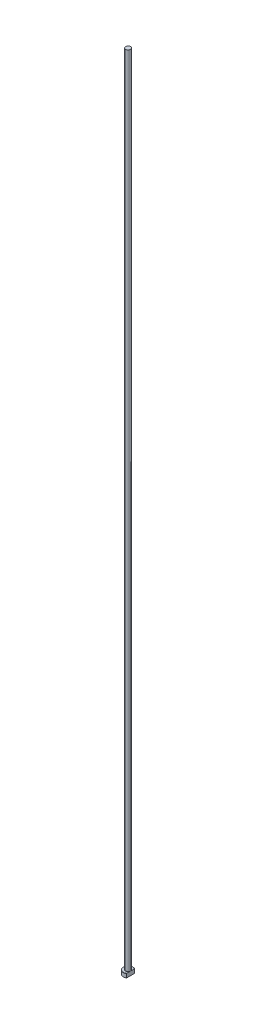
ISO-10303-21;
HEADER;
FILE_DESCRIPTION(('STEP AP214'),'2;1');
FILE_NAME('part.step','',(''),(''),'','','');
FILE_SCHEMA(('AUTOMOTIVE_DESIGN { 1 0 10303 214 1 1 1 1 }'));
ENDSEC;
DATA;
#1=APPLICATION_CONTEXT('core data for automotive mechanical design processes');
#2=APPLICATION_PROTOCOL_DEFINITION('international standard','automotive_design',2000,#1);
#3=PRODUCT_CONTEXT('',#1,'mechanical');
#4=PRODUCT('Part','Part','',(#3));
#5=PRODUCT_RELATED_PRODUCT_CATEGORY('part','',(#4));
#6=PRODUCT_DEFINITION_FORMATION('','',#4);
#7=PRODUCT_DEFINITION_CONTEXT('part definition',#1,'design');
#8=PRODUCT_DEFINITION('design','',#6,#7);
#9=PRODUCT_DEFINITION_SHAPE('','',#8);
#10=(LENGTH_UNIT() NAMED_UNIT(*) SI_UNIT(.MILLI.,.METRE.));
#11=(NAMED_UNIT(*) PLANE_ANGLE_UNIT() SI_UNIT($,.RADIAN.));
#12=(NAMED_UNIT(*) SI_UNIT($,.STERADIAN.) SOLID_ANGLE_UNIT());
#13=UNCERTAINTY_MEASURE_WITH_UNIT(LENGTH_MEASURE(1.E-05),#10,'distance_accuracy_value','');
#14=(GEOMETRIC_REPRESENTATION_CONTEXT(3) GLOBAL_UNCERTAINTY_ASSIGNED_CONTEXT((#13)) GLOBAL_UNIT_ASSIGNED_CONTEXT((#10,
#11,#12)) REPRESENTATION_CONTEXT('',''));
#15=CARTESIAN_POINT('',(0.,0.,0.));
#16=DIRECTION('',(0.,0.,1.));
#17=DIRECTION('',(1.,0.,0.));
#18=AXIS2_PLACEMENT_3D('',#15,#16,#17);
#19=CARTESIAN_POINT('',(0.,0.,0.));
#20=DIRECTION('',(0.,-1.,0.));
#21=DIRECTION('',(0.,0.,-1.));
#22=AXIS2_PLACEMENT_3D('',#19,#20,#21);
#23=PLANE('',#22);
#24=CARTESIAN_POINT('',(0.,0.,0.));
#25=DIRECTION('',(0.,-1.,0.));
#26=DIRECTION('',(0.,0.,-1.));
#27=AXIS2_PLACEMENT_3D('',#24,#25,#26);
#28=CIRCLE('',#27,5.79999999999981);
#29=CARTESIAN_POINT('',(2.99999999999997,0.,4.96386945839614));
#30=VERTEX_POINT('',#29);
#31=CARTESIAN_POINT('',(2.99999999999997,0.,-4.96386945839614));
#32=VERTEX_POINT('',#31);
#33=EDGE_CURVE('E98',#30,#32,#28,.T.);
#34=ORIENTED_EDGE('',*,*,#33,.T.);
#35=DIRECTION('',(0.,0.,1.));
#36=VECTOR('',#35,1.);
#37=CARTESIAN_POINT('',(2.99999999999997,0.,-5.19615242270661));
#38=LINE('',#37,#36);
#39=EDGE_CURVE('E83',#32,#30,#38,.T.);
#40=ORIENTED_EDGE('',*,*,#39,.T.);
#41=EDGE_LOOP('',(#34,#40));
#42=FACE_BOUND('',#41,.T.);
#43=ADVANCED_FACE('F32',(#42),#23,.T.);
#44=CARTESIAN_POINT('',(0.,259.958771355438,0.));
#45=DIRECTION('',(0.,1.,0.));
#46=DIRECTION('',(0.,0.,1.));
#47=AXIS2_PLACEMENT_3D('',#44,#45,#46);
#48=CYLINDRICAL_SURFACE('',#47,5.99999999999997);
#49=CARTESIAN_POINT('',(0.,4.80000000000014,0.));
#50=DIRECTION('',(0.,1.,0.));
#51=DIRECTION('',(0.,0.,1.));
#52=AXIS2_PLACEMENT_3D('',#49,#50,#51);
#53=CIRCLE('',#52,5.99999999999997);
#54=CARTESIAN_POINT('',(2.99999999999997,4.80000000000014,5.19615242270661));
#55=VERTEX_POINT('',#54);
#56=CARTESIAN_POINT('',(2.99999999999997,4.80000000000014,-5.19615242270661));
#57=VERTEX_POINT('',#56);
#58=EDGE_CURVE('E104',#55,#57,#53,.F.);
#59=ORIENTED_EDGE('',*,*,#58,.T.);
#60=DIRECTION('',(0.,-1.,0.));
#61=VECTOR('',#60,1.);
#62=CARTESIAN_POINT('',(2.99999999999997,1000.,-5.19615242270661));
#63=LINE('',#62,#61);
#64=CARTESIAN_POINT('',(2.99999999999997,0.200000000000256,-5.19615242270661));
#65=VERTEX_POINT('',#64);
#66=EDGE_CURVE('E183',#57,#65,#63,.T.);
#67=ORIENTED_EDGE('',*,*,#66,.T.);
#68=CARTESIAN_POINT('',(0.,0.200000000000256,0.));
#69=DIRECTION('',(0.,-1.,0.));
#70=DIRECTION('',(0.,0.,-1.));
#71=AXIS2_PLACEMENT_3D('',#68,#69,#70);
#72=CIRCLE('',#71,5.99999999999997);
#73=CARTESIAN_POINT('',(2.99999999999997,0.200000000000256,5.19615242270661));
#74=VERTEX_POINT('',#73);
#75=EDGE_CURVE('E100',#65,#74,#72,.F.);
#76=ORIENTED_EDGE('',*,*,#75,.T.);
#77=DIRECTION('',(0.,-1.,0.));
#78=VECTOR('',#77,1.);
#79=CARTESIAN_POINT('',(2.99999999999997,1000.,5.19615242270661));
#80=LINE('',#79,#78);
#81=EDGE_CURVE('E93',#55,#74,#80,.T.);
#82=ORIENTED_EDGE('',*,*,#81,.F.);
#83=EDGE_LOOP('',(#59,#67,#76,#82));
#84=FACE_BOUND('',#83,.T.);
#85=ADVANCED_FACE('F158',(#84),#48,.T.);
#86=CARTESIAN_POINT('',(-5.99999999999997,5.,0.));
#87=DIRECTION('',(0.,1.,0.));
#88=DIRECTION('',(0.,0.,1.));
#89=AXIS2_PLACEMENT_3D('',#86,#87,#88);
#90=PLANE('',#89);
#91=CARTESIAN_POINT('',(0.,5.,0.));
#92=DIRECTION('',(0.,1.,0.));
#93=DIRECTION('',(0.,0.,1.));
#94=AXIS2_PLACEMENT_3D('',#91,#92,#93);
#95=CIRCLE('',#94,5.80000000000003);
#96=CARTESIAN_POINT('',(2.99999999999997,5.,-4.9638694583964));
#97=VERTEX_POINT('',#96);
#98=CARTESIAN_POINT('',(2.99999999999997,5.,4.9638694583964));
#99=VERTEX_POINT('',#98);
#100=EDGE_CURVE('E178',#97,#99,#95,.T.);
#101=ORIENTED_EDGE('',*,*,#100,.T.);
#102=DIRECTION('',(0.,0.,-1.));
#103=VECTOR('',#102,1.);
#104=CARTESIAN_POINT('',(2.99999999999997,5.,0.));
#105=LINE('',#104,#103);
#106=CARTESIAN_POINT('',(2.99999999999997,4.99999999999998,1.11355287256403));
#107=VERTEX_POINT('',#106);
#108=EDGE_CURVE('E57',#99,#107,#105,.T.);
#109=ORIENTED_EDGE('',*,*,#108,.T.);
#110=CARTESIAN_POINT('',(0.,5.,0.));
#111=DIRECTION('',(0.,1.,0.));
#112=DIRECTION('',(0.,0.,1.));
#113=AXIS2_PLACEMENT_3D('',#110,#111,#112);
#114=CIRCLE('',#113,3.19999999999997);
#115=CARTESIAN_POINT('',(2.99999999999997,4.99999999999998,-1.113552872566));
#116=VERTEX_POINT('',#115);
#117=EDGE_CURVE('E107',#107,#116,#114,.F.);
#118=ORIENTED_EDGE('',*,*,#117,.T.);
#119=EDGE_CURVE('E136',#116,#97,#105,.T.);
#120=ORIENTED_EDGE('',*,*,#119,.T.);
#121=EDGE_LOOP('',(#101,#109,#118,#120));
#122=FACE_BOUND('',#121,.T.);
#123=ADVANCED_FACE('F147',(#122),#90,.T.);
#124=CARTESIAN_POINT('',(0.,5.,0.));
#125=DIRECTION('',(0.,-1.,0.));
#126=DIRECTION('',(0.,0.,-1.));
#127=AXIS2_PLACEMENT_3D('',#124,#125,#126);
#128=CONICAL_SURFACE('',#127,5.80000000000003,0.785398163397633);
#129=ORIENTED_EDGE('',*,*,#58,.F.);
#130=CARTESIAN_POINT('',(2.99999999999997,-1.01993959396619,11.432889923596));
#131=CARTESIAN_POINT('',(2.99999999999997,-0.769424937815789,11.1738796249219));
#132=CARTESIAN_POINT('',(2.99999999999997,-0.519179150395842,10.91460841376));
#133=CARTESIAN_POINT('',(2.99999999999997,-0.0193842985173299,10.3953890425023));
#134=CARTESIAN_POINT('',(2.99999999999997,0.230164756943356,10.135440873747));
#135=CARTESIAN_POINT('',(2.99999999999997,0.72852805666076,9.61458602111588));
#136=CARTESIAN_POINT('',(2.99999999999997,0.977341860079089,9.35367891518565));
#137=CARTESIAN_POINT('',(2.99999999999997,1.47386965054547,8.83082274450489));
#138=CARTESIAN_POINT('',(2.99999999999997,1.72158364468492,8.56887368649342));
#139=CARTESIAN_POINT('',(2.99999999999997,2.21069282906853,8.04884148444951));
#140=CARTESIAN_POINT('',(2.99999999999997,2.45211594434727,7.79078462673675));
#141=CARTESIAN_POINT('',(2.99999999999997,2.93315589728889,7.2729934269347));
#142=CARTESIAN_POINT('',(2.99999999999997,3.172772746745,7.01325909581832));
#143=CARTESIAN_POINT('',(2.99999999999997,3.64950020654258,6.49159990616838));
#144=CARTESIAN_POINT('',(2.99999999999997,3.8866113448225,6.22967553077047));
#145=CARTESIAN_POINT('',(2.99999999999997,4.35738571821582,5.70275148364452));
#146=CARTESIAN_POINT('',(2.99999999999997,4.59104909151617,5.43775193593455));
#147=CARTESIAN_POINT('',(2.99999999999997,4.96416348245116,5.00636825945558));
#148=CARTESIAN_POINT('',(2.99999999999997,5.10520133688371,4.8413584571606));
#149=CARTESIAN_POINT('',(2.99999999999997,5.38476673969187,4.50919282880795));
#150=CARTESIAN_POINT('',(2.99999999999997,5.52329404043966,4.34203679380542));
#151=CARTESIAN_POINT('',(2.99999999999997,5.79842961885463,4.00319933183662));
#152=CARTESIAN_POINT('',(2.99999999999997,5.93500216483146,3.83148875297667));
#153=CARTESIAN_POINT('',(2.99999999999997,6.20336281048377,3.48442112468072));
#154=CARTESIAN_POINT('',(2.99999999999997,6.33515205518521,3.30906496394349));
#155=CARTESIAN_POINT('',(2.99999999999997,6.59393382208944,2.95070802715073));
#156=CARTESIAN_POINT('',(2.99999999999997,6.72082315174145,2.76763161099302));
#157=CARTESIAN_POINT('',(2.99999999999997,6.90336321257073,2.48771743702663));
#158=CARTESIAN_POINT('',(2.99999999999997,6.96295431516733,2.39345390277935));
#159=CARTESIAN_POINT('',(2.99999999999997,7.07882720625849,2.2029214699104));
#160=CARTESIAN_POINT('',(2.99999999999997,7.13510937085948,2.10665280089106));
#161=CARTESIAN_POINT('',(2.99999999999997,7.24288059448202,1.91297779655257));
#162=CARTESIAN_POINT('',(2.99999999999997,7.29441986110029,1.81559978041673));
#163=CARTESIAN_POINT('',(2.99999999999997,7.3924123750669,1.61833215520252));
#164=CARTESIAN_POINT('',(2.99999999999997,7.4388646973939,1.51844209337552));
#165=CARTESIAN_POINT('',(2.99999999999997,7.56840030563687,1.2151194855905));
#166=CARTESIAN_POINT('',(2.99999999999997,7.642090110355,1.00730397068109));
#167=CARTESIAN_POINT('',(2.99999999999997,7.72186700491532,0.695731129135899));
#168=CARTESIAN_POINT('',(2.99999999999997,7.74302901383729,0.595791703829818));
#169=CARTESIAN_POINT('',(2.99999999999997,7.77582528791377,0.394325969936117));
#170=CARTESIAN_POINT('',(2.99999999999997,7.78746040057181,0.292799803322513));
#171=CARTESIAN_POINT('',(2.99999999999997,7.80037895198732,0.0893987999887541));
#172=CARTESIAN_POINT('',(2.99999999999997,7.80169449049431,-0.0124739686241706));
#173=CARTESIAN_POINT('',(2.99999999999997,7.79396363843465,-0.215826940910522));
#174=CARTESIAN_POINT('',(2.99999999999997,7.78491639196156,-0.317307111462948));
#175=CARTESIAN_POINT('',(2.99999999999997,7.75721241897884,-0.518039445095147));
#176=CARTESIAN_POINT('',(2.99999999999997,7.73863812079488,-0.617303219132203));
#177=CARTESIAN_POINT('',(2.99999999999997,7.69303955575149,-0.813850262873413));
#178=CARTESIAN_POINT('',(2.99999999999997,7.66601427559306,-0.911133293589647));
#179=CARTESIAN_POINT('',(2.99999999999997,7.60464499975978,-1.1039484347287));
#180=CARTESIAN_POINT('',(2.99999999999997,7.57025976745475,-1.19946724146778));
#181=CARTESIAN_POINT('',(2.99999999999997,7.49555762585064,-1.38810736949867));
#182=CARTESIAN_POINT('',(2.99999999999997,7.45524192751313,-1.48122917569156));
#183=CARTESIAN_POINT('',(2.99999999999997,7.36961028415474,-1.66561491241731));
#184=CARTESIAN_POINT('',(2.99999999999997,7.32427350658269,-1.75686908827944));
#185=CARTESIAN_POINT('',(2.99999999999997,7.22966073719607,-1.93732130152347));
#186=CARTESIAN_POINT('',(2.99999999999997,7.18038388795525,-2.02651888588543));
#187=CARTESIAN_POINT('',(2.99999999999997,7.02771106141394,-2.29153460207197));
#188=CARTESIAN_POINT('',(2.99999999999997,6.91955486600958,-2.46460625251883));
#189=CARTESIAN_POINT('',(2.99999999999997,6.69440299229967,-2.80577028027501));
#190=CARTESIAN_POINT('',(2.99999999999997,6.57737415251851,-2.97384034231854));
#191=CARTESIAN_POINT('',(2.99999999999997,6.33748949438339,-3.30561771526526));
#192=CARTESIAN_POINT('',(2.99999999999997,6.21463662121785,-3.46932716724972));
#193=CARTESIAN_POINT('',(2.99999999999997,5.9630808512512,-3.79561670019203));
#194=CARTESIAN_POINT('',(2.99999999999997,5.83432224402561,-3.95815356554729));
#195=CARTESIAN_POINT('',(2.99999999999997,5.57361365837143,-4.28066737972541));
#196=CARTESIAN_POINT('',(2.99999999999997,5.44166333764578,-4.44064405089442));
#197=CARTESIAN_POINT('',(2.99999999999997,5.17568445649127,-4.75819552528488));
#198=CARTESIAN_POINT('',(2.99999999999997,5.0416617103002,-4.91577521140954));
#199=CARTESIAN_POINT('',(2.99999999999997,4.7717623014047,-5.22934053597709));
#200=CARTESIAN_POINT('',(2.99999999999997,4.63588560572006,-5.38532614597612));
#201=CARTESIAN_POINT('',(2.99999999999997,4.27256222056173,-5.79849838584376));
#202=CARTESIAN_POINT('',(2.99999999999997,4.04384014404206,-6.05456265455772));
#203=CARTESIAN_POINT('',(2.99999999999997,3.58360020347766,-6.56417037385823));
#204=CARTESIAN_POINT('',(2.99999999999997,3.35208226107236,-6.81771375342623));
#205=CARTESIAN_POINT('',(2.99999999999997,2.88678846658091,-7.32315936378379));
#206=CARTESIAN_POINT('',(2.99999999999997,2.65301069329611,-7.5750598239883));
#207=CARTESIAN_POINT('',(2.99999999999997,2.18392232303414,-8.07742926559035));
#208=CARTESIAN_POINT('',(2.99999999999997,1.94861172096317,-8.32789824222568));
#209=CARTESIAN_POINT('',(2.99999999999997,1.48651581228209,-8.81743943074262));
#210=CARTESIAN_POINT('',(2.99999999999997,1.25977806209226,-9.05655656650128));
#211=CARTESIAN_POINT('',(2.99999999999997,0.805439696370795,-9.53397105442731));
#212=CARTESIAN_POINT('',(2.99999999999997,0.577839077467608,-9.77226840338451));
#213=CARTESIAN_POINT('',(2.99999999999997,0.122198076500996,-10.24793256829));
#214=CARTESIAN_POINT('',(2.99999999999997,-0.105841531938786,-10.4853001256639));
#215=CARTESIAN_POINT('',(2.99999999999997,-0.562491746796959,-10.9594816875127));
#216=CARTESIAN_POINT('',(2.99999999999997,-0.791102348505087,-11.196295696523));
#217=CARTESIAN_POINT('',(2.99999999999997,-1.01993959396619,-11.432889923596));
#218=B_SPLINE_CURVE_WITH_KNOTS('',3,(#130,#131,#132,#133,#134,#135,#136,#137,#138,#139,#140,
#141,#142,#143,#144,#145,#146,#147,#148,#149,#150,#151,#152,#153,#154,#155,#156,#157,#158,#159,
#160,#161,#162,#163,#164,#165,#166,#167,#168,#169,#170,#171,#172,#173,#174,#175,#176,#177,#178,
#179,#180,#181,#182,#183,#184,#185,#186,#187,#188,#189,#190,#191,#192,#193,#194,#195,#196,#197,
#198,#199,#200,#201,#202,#203,#204,#205,#206,#207,#208,#209,#210,#211,#212,#213,#214,#215,#216,
#217),.UNSPECIFIED.,.F.,.F.,(4,2,2,2,2,2,2,2,2,2,2,2,2,2,2,2,2,2,2,2,2,2,2,2,2,2,2,2,2,2,2,2,2,
2,2,2,2,2,2,2,2,2,2,4),(0.,1.08101662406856,2.16204714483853,3.24363027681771,4.32520642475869,
5.3853446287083,6.44547590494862,7.50537917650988,8.56523985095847,9.21643479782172,
9.86769362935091,10.5258323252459,11.183812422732,11.8517813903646,12.1862877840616,
12.5207560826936,12.8511332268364,13.1815703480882,13.8399161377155,14.1460077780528,
14.4520721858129,14.7571841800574,15.0623213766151,15.3648619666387,15.6674388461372,
15.9717575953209,16.2760142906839,16.5815843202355,16.8872210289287,17.4990577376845,
18.1133060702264,18.7272470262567,19.3492675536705,19.9713550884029,20.5919343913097,
21.2125247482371,22.2425132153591,23.272530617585,24.3035181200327,25.3345090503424,
26.3230827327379,27.3116602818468,28.2991352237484,29.2866020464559),.UNSPECIFIED.);
#219=EDGE_CURVE('E135',#55,#99,#218,.T.);
#220=ORIENTED_EDGE('',*,*,#219,.T.);
#221=ORIENTED_EDGE('',*,*,#100,.F.);
#222=EDGE_CURVE('E127',#97,#57,#218,.T.);
#223=ORIENTED_EDGE('',*,*,#222,.T.);
#224=EDGE_LOOP('',(#129,#220,#221,#223));
#225=FACE_BOUND('',#224,.T.);
#226=ADVANCED_FACE('F143',(#225),#128,.T.);
#227=CARTESIAN_POINT('',(0.,0.200000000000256,0.));
#228=DIRECTION('',(0.,1.,0.));
#229=DIRECTION('',(0.,0.,1.));
#230=AXIS2_PLACEMENT_3D('',#227,#228,#229);
#231=CONICAL_SURFACE('',#230,5.99999999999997,0.785398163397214);
#232=ORIENTED_EDGE('',*,*,#75,.F.);
#233=CARTESIAN_POINT('',(2.99999999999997,6.01993959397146,-11.432889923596));
#234=CARTESIAN_POINT('',(2.99999999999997,5.7694249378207,-11.1738796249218));
#235=CARTESIAN_POINT('',(2.99999999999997,5.51917915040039,-10.9146084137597));
#236=CARTESIAN_POINT('',(2.99999999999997,5.01938429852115,-10.3953890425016));
#237=CARTESIAN_POINT('',(2.99999999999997,4.76983524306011,-10.1354408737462));
#238=CARTESIAN_POINT('',(2.99999999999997,4.27147194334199,-9.61458602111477));
#239=CARTESIAN_POINT('',(2.99999999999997,4.0226581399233,-9.35367891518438));
#240=CARTESIAN_POINT('',(2.99999999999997,3.5261303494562,-8.8308227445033));
#241=CARTESIAN_POINT('',(2.99999999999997,3.2784163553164,-8.56887368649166));
#242=CARTESIAN_POINT('',(2.99999999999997,2.78930717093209,-8.04884148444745));
#243=CARTESIAN_POINT('',(2.99999999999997,2.54788405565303,-7.79078462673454));
#244=CARTESIAN_POINT('',(2.99999999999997,2.06684410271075,-7.27299342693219));
#245=CARTESIAN_POINT('',(2.99999999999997,1.82722725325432,-7.01325909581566));
#246=CARTESIAN_POINT('',(2.99999999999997,1.35049979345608,-6.49159990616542));
#247=CARTESIAN_POINT('',(2.99999999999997,1.11338865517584,-6.22967553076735));
#248=CARTESIAN_POINT('',(2.99999999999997,0.64261428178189,-5.70275148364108));
#249=CARTESIAN_POINT('',(2.99999999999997,0.408950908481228,-5.43775193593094));
#250=CARTESIAN_POINT('',(2.99999999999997,0.0358365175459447,-5.00636825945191));
#251=CARTESIAN_POINT('',(2.99999999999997,-0.1052013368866,-4.84135845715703));
#252=CARTESIAN_POINT('',(2.99999999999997,-0.384766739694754,-4.5091928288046));
#253=CARTESIAN_POINT('',(2.99999999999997,-0.523294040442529,-4.34203679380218));
#254=CARTESIAN_POINT('',(2.99999999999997,-0.798429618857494,-4.00319933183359));
#255=CARTESIAN_POINT('',(2.99999999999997,-0.935002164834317,-3.83148875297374));
#256=CARTESIAN_POINT('',(2.99999999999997,-1.20336281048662,-3.48442112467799));
#257=CARTESIAN_POINT('',(2.99999999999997,-1.33515205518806,-3.30906496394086));
#258=CARTESIAN_POINT('',(2.99999999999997,-1.59393382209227,-2.95070802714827));
#259=CARTESIAN_POINT('',(2.99999999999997,-1.72082315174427,-2.76763161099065));
#260=CARTESIAN_POINT('',(2.99999999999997,-1.90336321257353,-2.48771743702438));
#261=CARTESIAN_POINT('',(2.99999999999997,-1.96295431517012,-2.39345390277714));
#262=CARTESIAN_POINT('',(2.99999999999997,-2.07882720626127,-2.20292146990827));
#263=CARTESIAN_POINT('',(2.99999999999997,-2.13510937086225,-2.10665280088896));
#264=CARTESIAN_POINT('',(2.99999999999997,-2.24288059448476,-1.91297779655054));
#265=CARTESIAN_POINT('',(2.99999999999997,-2.29441986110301,-1.81559978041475));
#266=CARTESIAN_POINT('',(2.99999999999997,-2.39241237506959,-1.61833215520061));
#267=CARTESIAN_POINT('',(2.99999999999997,-2.43886469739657,-1.51844209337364));
#268=CARTESIAN_POINT('',(2.99999999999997,-2.56840030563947,-1.21511948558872));
#269=CARTESIAN_POINT('',(2.99999999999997,-2.64209011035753,-1.00730397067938));
#270=CARTESIAN_POINT('',(2.99999999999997,-2.72186700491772,-0.695731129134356));
#271=CARTESIAN_POINT('',(2.99999999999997,-2.74302901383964,-0.595791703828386));
#272=CARTESIAN_POINT('',(2.99999999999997,-2.77582528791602,-0.394325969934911));
#273=CARTESIAN_POINT('',(2.99999999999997,-2.78746040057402,-0.292799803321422));
#274=CARTESIAN_POINT('',(2.99999999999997,-2.80037895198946,-0.0893987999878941));
#275=CARTESIAN_POINT('',(2.99999999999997,-2.80169449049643,0.0124739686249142));
#276=CARTESIAN_POINT('',(2.99999999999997,-2.79396363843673,0.215826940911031));
#277=CARTESIAN_POINT('',(2.99999999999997,-2.78491639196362,0.317307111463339));
#278=CARTESIAN_POINT('',(2.99999999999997,-2.7572124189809,0.518039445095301));
#279=CARTESIAN_POINT('',(2.99999999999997,-2.73863812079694,0.617303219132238));
#280=CARTESIAN_POINT('',(2.99999999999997,-2.69303955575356,0.813850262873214));
#281=CARTESIAN_POINT('',(2.99999999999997,-2.66601427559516,0.911133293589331));
#282=CARTESIAN_POINT('',(2.99999999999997,-2.60464499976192,1.10394843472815));
#283=CARTESIAN_POINT('',(2.99999999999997,-2.57025976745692,1.19946724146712));
#284=CARTESIAN_POINT('',(2.99999999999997,-2.49555762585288,1.38810736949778));
#285=CARTESIAN_POINT('',(2.99999999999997,-2.45524192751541,1.48122917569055));
#286=CARTESIAN_POINT('',(2.99999999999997,-2.36961028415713,1.66561491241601));
#287=CARTESIAN_POINT('',(2.99999999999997,-2.32427350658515,1.75686908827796));
#288=CARTESIAN_POINT('',(2.99999999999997,-2.2296607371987,1.93732130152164));
#289=CARTESIAN_POINT('',(2.99999999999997,-2.18038388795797,2.02651888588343));
#290=CARTESIAN_POINT('',(2.99999999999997,-2.02771106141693,2.29153460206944));
#291=CARTESIAN_POINT('',(2.99999999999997,-1.91955486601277,2.46460625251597));
#292=CARTESIAN_POINT('',(2.99999999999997,-1.69440299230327,2.80577028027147));
#293=CARTESIAN_POINT('',(2.99999999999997,-1.57737415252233,2.97384034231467));
#294=CARTESIAN_POINT('',(2.99999999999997,-1.33748949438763,3.30561771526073));
#295=CARTESIAN_POINT('',(2.99999999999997,-1.21463662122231,3.46932716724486));
#296=CARTESIAN_POINT('',(2.99999999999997,-0.963080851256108,3.79561670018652));
#297=CARTESIAN_POINT('',(2.99999999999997,-0.834322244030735,3.95815356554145));
#298=CARTESIAN_POINT('',(2.99999999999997,-0.573613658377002,4.28066737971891));
#299=CARTESIAN_POINT('',(2.99999999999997,-0.441663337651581,4.4406440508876));
#300=CARTESIAN_POINT('',(2.99999999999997,-0.175684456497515,4.75819552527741));
#301=CARTESIAN_POINT('',(2.99999999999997,-0.0416617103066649,4.91577521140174));
#302=CARTESIAN_POINT('',(2.99999999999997,0.228237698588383,5.22934053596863));
#303=CARTESIAN_POINT('',(2.99999999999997,0.364114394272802,5.38532614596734));
#304=CARTESIAN_POINT('',(2.99999999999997,0.727437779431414,5.79849838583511));
#305=CARTESIAN_POINT('',(2.99999999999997,0.956159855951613,6.05456265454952));
#306=CARTESIAN_POINT('',(2.99999999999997,1.41639979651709,6.5641703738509));
#307=CARTESIAN_POINT('',(2.99999999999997,1.64791773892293,6.81771375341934));
#308=CARTESIAN_POINT('',(2.99999999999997,2.11321153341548,7.32315936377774));
#309=CARTESIAN_POINT('',(2.99999999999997,2.34698930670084,7.57505982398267));
#310=CARTESIAN_POINT('',(2.99999999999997,2.81607767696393,8.07742926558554));
#311=CARTESIAN_POINT('',(2.99999999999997,3.05138827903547,8.32789824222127));
#312=CARTESIAN_POINT('',(2.99999999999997,3.51348418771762,8.81743943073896));
#313=CARTESIAN_POINT('',(2.99999999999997,3.74022193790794,9.05655656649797));
#314=CARTESIAN_POINT('',(2.99999999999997,4.19456030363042,9.53397105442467));
#315=CARTESIAN_POINT('',(2.99999999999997,4.42216092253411,9.7722684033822));
#316=CARTESIAN_POINT('',(2.99999999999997,4.87780192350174,10.2479325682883));
#317=CARTESIAN_POINT('',(2.99999999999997,5.10584153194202,10.4853001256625));
#318=CARTESIAN_POINT('',(2.99999999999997,5.56249174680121,10.959481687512));
#319=CARTESIAN_POINT('',(2.99999999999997,5.79110234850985,11.1962956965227));
#320=CARTESIAN_POINT('',(2.99999999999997,6.01993959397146,11.432889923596));
#321=B_SPLINE_CURVE_WITH_KNOTS('',3,(#233,#234,#235,#236,#237,#238,#239,#240,#241,#242,#243,
#244,#245,#246,#247,#248,#249,#250,#251,#252,#253,#254,#255,#256,#257,#258,#259,#260,#261,#262,
#263,#264,#265,#266,#267,#268,#269,#270,#271,#272,#273,#274,#275,#276,#277,#278,#279,#280,#281,
#282,#283,#284,#285,#286,#287,#288,#289,#290,#291,#292,#293,#294,#295,#296,#297,#298,#299,#300,
#301,#302,#303,#304,#305,#306,#307,#308,#309,#310,#311,#312,#313,#314,#315,#316,#317,#318,#319,
#320),.UNSPECIFIED.,.F.,.F.,(4,2,2,2,2,2,2,2,2,2,2,2,2,2,2,2,2,2,2,2,2,2,2,2,2,2,2,2,2,2,2,2,2,
2,2,2,2,2,2,2,2,2,2,4),(0.,1.08101662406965,2.16204714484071,3.24363027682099,4.32520642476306,
5.38534462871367,6.44547590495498,7.50537917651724,8.56523985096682,9.2164347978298,
9.86769362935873,10.5258323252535,11.1838124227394,11.8517813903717,12.1862877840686,
12.5207560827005,12.8511332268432,13.1815703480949,13.8399161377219,14.1460077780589,
14.4520721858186,14.7571841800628,15.0623213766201,15.3648619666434,15.6674388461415,
15.9717575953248,16.2760142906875,16.5815843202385,16.8872210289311,17.4990577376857,
18.1133060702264,18.7272470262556,19.3492675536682,19.9713550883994,20.591934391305,
21.2125247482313,22.2425132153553,23.2725306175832,24.303518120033,25.3345090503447,
26.3230827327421,27.3116602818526,28.2991352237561,29.2866020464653),.UNSPECIFIED.);
#322=EDGE_CURVE('E86',#65,#32,#321,.T.);
#323=ORIENTED_EDGE('',*,*,#322,.T.);
#324=ORIENTED_EDGE('',*,*,#33,.F.);
#325=EDGE_CURVE('E89',#30,#74,#321,.T.);
#326=ORIENTED_EDGE('',*,*,#325,.T.);
#327=EDGE_LOOP('',(#232,#323,#324,#326));
#328=FACE_BOUND('',#327,.T.);
#329=ADVANCED_FACE('F97',(#328),#231,.T.);
#330=CARTESIAN_POINT('',(0.,5.19999999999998,0.));
#331=DIRECTION('',(0.,1.,0.));
#332=DIRECTION('',(0.,0.,1.));
#333=AXIS2_PLACEMENT_3D('',#330,#331,#332);
#334=TOROIDAL_SURFACE('',#333,3.19999999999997,0.2);
#335=CARTESIAN_POINT('',(2.99999999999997,5.19999999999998,0.));
#336=CARTESIAN_POINT('',(2.99999999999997,5.20000054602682,-8.25589702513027E-09));
#337=CARTESIAN_POINT('',(2.99999999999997,5.20000108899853,-2.22623702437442E-07));
#338=CARTESIAN_POINT('',(2.99999999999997,5.20000210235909,-8.13181300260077E-07));
#339=CARTESIAN_POINT('',(2.99999999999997,5.20000256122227,-1.20262206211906E-06));
#340=CARTESIAN_POINT('',(2.99999999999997,5.20000351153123,-2.13233189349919E-06));
#341=CARTESIAN_POINT('',(2.99999999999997,5.2000039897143,-2.68711073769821E-06));
#342=CARTESIAN_POINT('',(2.99999999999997,5.20000484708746,-3.83722986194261E-06));
#343=CARTESIAN_POINT('',(2.99999999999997,5.20000522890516,-4.43075968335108E-06));
#344=CARTESIAN_POINT('',(2.99999999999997,5.20000663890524,-6.71805399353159E-06));
#345=CARTESIAN_POINT('',(2.99999999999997,5.20000758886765,-8.46267320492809E-06));
#346=CARTESIAN_POINT('',(2.99999999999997,5.20000915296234,-1.19195937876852E-05));
#347=CARTESIAN_POINT('',(2.99999999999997,5.20000978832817,-1.36226966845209E-05));
#348=CARTESIAN_POINT('',(2.99999999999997,5.20001243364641,-2.07785327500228E-05));
#349=CARTESIAN_POINT('',(2.99999999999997,5.20001439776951,-2.62512686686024E-05));
#350=CARTESIAN_POINT('',(2.99999999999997,5.20001730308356,-3.65971251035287E-05));
#351=CARTESIAN_POINT('',(2.99999999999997,5.20001835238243,-4.14397201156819E-05));
#352=CARTESIAN_POINT('',(2.99999999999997,5.20002589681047,-7.68826107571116E-05));
#353=CARTESIAN_POINT('',(2.99999999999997,5.20003169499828,-0.000107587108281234));
#354=CARTESIAN_POINT('',(2.99999999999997,5.20005649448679,-0.000225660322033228));
#355=CARTESIAN_POINT('',(2.99999999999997,5.2000799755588,-0.000312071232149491));
#356=CARTESIAN_POINT('',(2.99999999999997,5.2001671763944,-0.000638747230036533));
#357=CARTESIAN_POINT('',(2.99999999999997,5.20022823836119,-0.000879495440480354));
#358=CARTESIAN_POINT('',(2.99999999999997,5.20046253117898,-0.00179757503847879));
#359=CARTESIAN_POINT('',(2.99999999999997,5.20063826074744,-0.00247448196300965));
#360=CARTESIAN_POINT('',(2.99999999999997,5.20145771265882,-0.00563611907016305));
#361=CARTESIAN_POINT('',(2.99999999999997,5.20209802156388,-0.00812138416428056));
#362=CARTESIAN_POINT('',(2.99999999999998,5.207470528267,-0.0289666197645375));
#363=CARTESIAN_POINT('',(2.99999999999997,5.2122144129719,-0.0473249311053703));
#364=CARTESIAN_POINT('',(2.99999999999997,5.2215041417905,-0.0833908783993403));
#365=CARTESIAN_POINT('',(2.99999999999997,5.22605099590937,-0.101098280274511));
#366=CARTESIAN_POINT('',(2.99999999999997,5.24071513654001,-0.158441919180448));
#367=CARTESIAN_POINT('',(2.99999999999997,5.25076238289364,-0.198096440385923));
#368=CARTESIAN_POINT('',(2.99999999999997,5.26735876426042,-0.264903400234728));
#369=CARTESIAN_POINT('',(2.99999999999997,5.27400650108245,-0.292031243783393));
#370=CARTESIAN_POINT('',(2.99999999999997,5.28691139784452,-0.345693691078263));
#371=CARTESIAN_POINT('',(2.99999999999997,5.29317409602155,-0.372226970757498));
#372=CARTESIAN_POINT('',(2.99999999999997,5.31359314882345,-0.460847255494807));
#373=CARTESIAN_POINT('',(2.99999999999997,5.3271194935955,-0.52308420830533));
#374=CARTESIAN_POINT('',(2.99999999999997,5.35185224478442,-0.648627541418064));
#375=CARTESIAN_POINT('',(2.99999999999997,5.36303576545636,-0.711938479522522));
#376=CARTESIAN_POINT('',(2.99999999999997,5.382697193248,-0.845442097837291));
#377=CARTESIAN_POINT('',(2.99999999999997,5.39079783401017,-0.915695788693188));
#378=CARTESIAN_POINT('',(2.99999999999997,5.39788104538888,-1.02128246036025));
#379=CARTESIAN_POINT('',(2.99999999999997,5.399399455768,-1.05644278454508));
#380=CARTESIAN_POINT('',(2.99999999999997,5.40031405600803,-1.12678521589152));
#381=CARTESIAN_POINT('',(2.99999999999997,5.39971158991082,-1.16196729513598));
#382=CARTESIAN_POINT('',(2.99999999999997,5.39660553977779,-1.21713951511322));
#383=CARTESIAN_POINT('',(2.99999999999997,5.39502683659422,-1.23718181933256));
#384=CARTESIAN_POINT('',(2.99999999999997,5.39080008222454,-1.27717351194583));
#385=CARTESIAN_POINT('',(2.99999999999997,5.38815120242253,-1.29712281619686));
#386=CARTESIAN_POINT('',(2.99999999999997,5.38160570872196,-1.33655702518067));
#387=CARTESIAN_POINT('',(2.99999999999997,5.37772556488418,-1.35604460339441));
#388=CARTESIAN_POINT('',(2.99999999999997,5.36841119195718,-1.39463554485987));
#389=CARTESIAN_POINT('',(2.99999999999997,5.36297874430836,-1.41373932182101));
#390=CARTESIAN_POINT('',(2.99999999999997,5.3500393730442,-1.45151809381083));
#391=CARTESIAN_POINT('',(2.99999999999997,5.34250654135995,-1.47018435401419));
#392=CARTESIAN_POINT('',(2.99999999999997,5.32469433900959,-1.50617232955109));
#393=CARTESIAN_POINT('',(2.99999999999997,5.31442814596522,-1.52349999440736));
#394=CARTESIAN_POINT('',(2.99999999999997,5.29768486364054,-1.5453003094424));
#395=CARTESIAN_POINT('',(2.99999999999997,5.29285641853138,-1.551032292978));
#396=CARTESIAN_POINT('',(2.99999999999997,5.28257691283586,-1.56192749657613));
#397=CARTESIAN_POINT('',(2.99999999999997,5.27712536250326,-1.56709026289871));
#398=CARTESIAN_POINT('',(2.99999999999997,5.26548354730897,-1.57666725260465));
#399=CARTESIAN_POINT('',(2.99999999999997,5.25928560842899,-1.58107232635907));
#400=CARTESIAN_POINT('',(2.99999999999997,5.24620912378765,-1.5887219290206));
#401=CARTESIAN_POINT('',(2.99999999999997,5.23933242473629,-1.59196950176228));
#402=CARTESIAN_POINT('',(2.99999999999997,5.22702406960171,-1.5962468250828));
#403=CARTESIAN_POINT('',(2.99999999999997,5.2217197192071,-1.59764171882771));
#404=CARTESIAN_POINT('',(2.99999999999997,5.2109516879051,-1.59951721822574));
#405=CARTESIAN_POINT('',(2.99999999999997,5.20548813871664,-1.59999855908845));
#406=CARTESIAN_POINT('',(2.99999999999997,5.19455397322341,-1.60000143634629));
#407=CARTESIAN_POINT('',(2.99999999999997,5.18908335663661,-1.59952177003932));
#408=CARTESIAN_POINT('',(2.99999999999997,5.17830149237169,-1.59764696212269));
#409=CARTESIAN_POINT('',(2.99999999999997,5.17299036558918,-1.59625114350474));
#410=CARTESIAN_POINT('',(2.99999999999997,5.16137413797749,-1.5922159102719));
#411=CARTESIAN_POINT('',(2.99999999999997,5.15514663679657,-1.58935479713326));
#412=CARTESIAN_POINT('',(2.99999999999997,5.14323789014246,-1.58266473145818));
#413=CARTESIAN_POINT('',(2.99999999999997,5.13755768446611,-1.57883398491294));
#414=CARTESIAN_POINT('',(2.99999999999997,5.12388989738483,-1.5682309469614));
#415=CARTESIAN_POINT('',(2.99999999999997,5.11627920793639,-1.56097697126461));
#416=CARTESIAN_POINT('',(2.99999999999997,5.10222993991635,-1.54541986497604));
#417=CARTESIAN_POINT('',(2.99999999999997,5.09579438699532,-1.53711411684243));
#418=CARTESIAN_POINT('',(2.99999999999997,5.07874447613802,-1.51234359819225));
#419=CARTESIAN_POINT('',(2.99999999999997,5.06934681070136,-1.49505024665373));
#420=CARTESIAN_POINT('',(2.99999999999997,5.05300413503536,-1.45936637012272));
#421=CARTESIAN_POINT('',(2.99999999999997,5.04606563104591,-1.440973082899));
#422=CARTESIAN_POINT('',(2.99999999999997,5.03343712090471,-1.40170303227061));
#423=CARTESIAN_POINT('',(2.99999999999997,5.02794514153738,-1.38076360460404));
#424=CARTESIAN_POINT('',(2.99999999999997,5.01869119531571,-1.33849708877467));
#425=CARTESIAN_POINT('',(2.99999999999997,5.01493126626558,-1.31716957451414));
#426=CARTESIAN_POINT('',(2.99999999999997,5.00879575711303,-1.27427301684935));
#427=CARTESIAN_POINT('',(2.99999999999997,5.00642327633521,-1.25270354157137));
#428=CARTESIAN_POINT('',(2.99999999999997,5.00283272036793,-1.20948719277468));
#429=CARTESIAN_POINT('',(2.99999999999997,5.00161392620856,-1.18784037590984));
#430=CARTESIAN_POINT('',(2.99999999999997,4.99921193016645,-1.11739576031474));
#431=CARTESIAN_POINT('',(2.99999999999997,4.99998309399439,-1.06853061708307));
#432=CARTESIAN_POINT('',(2.99999999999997,5.00498456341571,-0.970964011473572));
#433=CARTESIAN_POINT('',(2.99999999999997,5.00921876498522,-0.922262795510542));
#434=CARTESIAN_POINT('',(2.99999999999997,5.02027934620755,-0.825023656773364));
#435=CARTESIAN_POINT('',(2.99999999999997,5.02711306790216,-0.776486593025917));
#436=CARTESIAN_POINT('',(2.99999999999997,5.04272509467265,-0.679720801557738));
#437=CARTESIAN_POINT('',(2.99999999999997,5.05150395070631,-0.631492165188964));
#438=CARTESIAN_POINT('',(2.99999999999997,5.07999589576,-0.487173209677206));
#439=CARTESIAN_POINT('',(2.99999999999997,5.10185558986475,-0.391514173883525));
#440=CARTESIAN_POINT('',(2.99999999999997,5.14819769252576,-0.200831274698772));
#441=CARTESIAN_POINT('',(2.99999999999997,5.17268119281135,-0.105807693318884));
#442=CARTESIAN_POINT('',(2.99999999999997,5.19722910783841,-0.0107318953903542));
#443=CARTESIAN_POINT('',(2.99999999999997,5.19724528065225,-0.0106692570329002));
#444=CARTESIAN_POINT('',(2.99999999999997,5.19781243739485,-0.00847232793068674));
#445=CARTESIAN_POINT('',(2.99999999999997,5.19836102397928,-0.00633759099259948));
#446=CARTESIAN_POINT('',(2.99999999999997,5.1991597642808,-0.00325873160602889));
#447=CARTESIAN_POINT('',(2.99999999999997,5.19940591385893,-0.00231386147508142));
#448=CARTESIAN_POINT('',(2.99999999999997,5.19972567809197,-0.00105818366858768));
#449=CARTESIAN_POINT('',(2.99999999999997,5.19980400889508,-0.000748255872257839));
#450=CARTESIAN_POINT('',(2.99999999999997,5.1999122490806,-0.000340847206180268));
#451=CARTESIAN_POINT('',(2.99999999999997,5.19993871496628,-0.000242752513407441));
#452=CARTESIAN_POINT('',(2.99999999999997,5.19996623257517,-0.000111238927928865));
#453=CARTESIAN_POINT('',(2.99999999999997,5.19997237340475,-7.89037769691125E-05));
#454=CARTESIAN_POINT('',(2.99999999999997,5.19998062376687,-4.17973012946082E-05));
#455=CARTESIAN_POINT('',(2.99999999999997,5.19998174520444,-3.68646325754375E-05));
#456=CARTESIAN_POINT('',(2.99999999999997,5.19998486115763,-2.6333709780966E-05));
#457=CARTESIAN_POINT('',(2.99999999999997,5.19998697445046,-2.0770778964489E-05));
#458=CARTESIAN_POINT('',(2.99999999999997,5.19998981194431,-1.35213137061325E-05));
#459=CARTESIAN_POINT('',(2.99999999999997,5.19999048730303,-1.18115060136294E-05));
#460=CARTESIAN_POINT('',(2.99999999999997,5.19999214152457,-8.34771962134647E-06));
#461=CARTESIAN_POINT('',(2.99999999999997,5.19999314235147,-6.60378870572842E-06));
#462=CARTESIAN_POINT('',(2.99999999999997,5.1999946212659,-4.32501646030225E-06));
#463=CARTESIAN_POINT('',(2.99999999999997,5.1999950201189,-3.73587510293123E-06));
#464=CARTESIAN_POINT('',(2.99999999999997,5.19999591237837,-2.59760768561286E-06));
#465=CARTESIAN_POINT('',(2.99999999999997,5.19999640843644,-2.05040430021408E-06));
#466=CARTESIAN_POINT('',(2.99999999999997,5.19999738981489,-1.1384674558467E-06));
#467=CARTESIAN_POINT('',(2.99999999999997,5.19999786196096,-7.58552551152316E-07));
#468=CARTESIAN_POINT('',(2.99999999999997,5.19999889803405,-1.92079005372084E-07));
#469=CARTESIAN_POINT('',(2.99999999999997,5.19999945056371,8.30744745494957E-09));
#470=CARTESIAN_POINT('',(2.99999999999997,5.19999999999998,0.));
#471=B_SPLINE_CURVE_WITH_KNOTS('',3,(#335,#336,#337,#338,#339,#340,#341,#342,#343,#344,#345,
#346,#347,#348,#349,#350,#351,#352,#353,#354,#355,#356,#357,#358,#359,#360,#361,#362,#363,#364,
#365,#366,#367,#368,#369,#370,#371,#372,#373,#374,#375,#376,#377,#378,#379,#380,#381,#382,#383,
#384,#385,#386,#387,#388,#389,#390,#391,#392,#393,#394,#395,#396,#397,#398,#399,#400,#401,#402,
#403,#404,#405,#406,#407,#408,#409,#410,#411,#412,#413,#414,#415,#416,#417,#418,#419,#420,#421,
#422,#423,#424,#425,#426,#427,#428,#429,#430,#431,#432,#433,#434,#435,#436,#437,#438,#439,#440,
#441,#442,#443,#444,#445,#446,#447,#448,#449,#450,#451,#452,#453,#454,#455,#456,#457,#458,#459,
#460,#461,#462,#463,#464,#465,#466,#467,#468,#469,#470),.UNSPECIFIED.,.T.,.F.,(4,2,2,2,2,2,2,2,
2,2,2,2,2,2,2,2,2,2,2,2,2,2,2,2,2,2,2,2,2,2,2,2,2,2,2,2,2,2,2,2,2,2,2,2,2,2,2,2,2,2,2,2,2,2,2,2,
2,2,2,2,2,2,2,2,2,2,2,4),(0.,1.65204701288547E-06,3.45848810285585E-06,5.64280272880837E-06,
7.75882449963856E-06,1.36969712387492E-05,1.9145444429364E-05,3.65603925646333E-05,
5.14083087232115E-05,0.000145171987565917,0.000413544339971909,0.00115890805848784,
0.00325667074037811,0.0109563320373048,0.067838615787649,0.122684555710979,0.245405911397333,
0.329196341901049,0.410983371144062,0.602016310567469,0.79483628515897,1.00673763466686,
1.11227258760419,1.21774067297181,1.27803175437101,1.33836960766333,1.39793215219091,
1.45742661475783,1.51769013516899,1.57766822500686,1.60011625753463,1.62258205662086,
1.64530254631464,1.66796284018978,1.68434680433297,1.70071757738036,1.71710885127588,
1.7335122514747,1.75395806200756,1.77444198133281,1.8058056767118,1.83724902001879,
1.89596356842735,1.95483231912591,2.01967230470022,2.08458838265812,2.14964892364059,
2.21466889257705,2.3610799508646,2.50765595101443,2.65464904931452,2.80168383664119,
3.09594779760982,3.39033467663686,3.39052875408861,3.3971415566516,3.40007033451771,
3.40102967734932,3.4013342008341,3.40143296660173,3.40144812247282,3.40146594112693,
3.40147145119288,3.401477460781,3.40147959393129,3.40148179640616,3.40148361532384,
3.40148527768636),.UNSPECIFIED.);
#472=CARTESIAN_POINT('',(2.99999999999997,5.19999999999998,0.));
#473=VERTEX_POINT('',#472);
#474=EDGE_CURVE('E11',#116,#473,#471,.T.);
#475=ORIENTED_EDGE('',*,*,#474,.F.);
#476=ORIENTED_EDGE('',*,*,#117,.F.);
#477=CARTESIAN_POINT('',(2.99999999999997,5.19999999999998,0.));
#478=CARTESIAN_POINT('',(2.99999999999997,5.19999945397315,8.25589702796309E-09));
#479=CARTESIAN_POINT('',(2.99999999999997,5.19999891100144,2.22623702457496E-07));
#480=CARTESIAN_POINT('',(2.99999999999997,5.19999789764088,8.13181300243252E-07));
#481=CARTESIAN_POINT('',(2.99999999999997,5.19999743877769,1.20262206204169E-06));
#482=CARTESIAN_POINT('',(2.99999999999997,5.19999648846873,2.13233189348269E-06));
#483=CARTESIAN_POINT('',(2.99999999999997,5.19999601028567,2.68711073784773E-06));
#484=CARTESIAN_POINT('',(2.99999999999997,5.19999515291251,3.83722986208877E-06));
#485=CARTESIAN_POINT('',(2.99999999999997,5.1999947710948,4.43075968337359E-06));
#486=CARTESIAN_POINT('',(2.99999999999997,5.19999336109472,6.71805399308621E-06));
#487=CARTESIAN_POINT('',(2.99999999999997,5.19999241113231,8.46267320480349E-06));
#488=CARTESIAN_POINT('',(2.99999999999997,5.19999084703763,1.19195937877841E-05));
#489=CARTESIAN_POINT('',(2.99999999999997,5.1999902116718,1.36226966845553E-05));
#490=CARTESIAN_POINT('',(2.99999999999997,5.19998756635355,2.07785327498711E-05));
#491=CARTESIAN_POINT('',(2.99999999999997,5.19998560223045,2.62512686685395E-05));
#492=CARTESIAN_POINT('',(2.99999999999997,5.1999826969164,3.65971251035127E-05));
#493=CARTESIAN_POINT('',(2.99999999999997,5.19998164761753,4.14397201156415E-05));
#494=CARTESIAN_POINT('',(2.99999999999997,5.19997410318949,7.68826107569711E-05));
#495=CARTESIAN_POINT('',(2.99999999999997,5.19996830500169,0.000107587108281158));
#496=CARTESIAN_POINT('',(2.99999999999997,5.19994350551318,0.000225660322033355));
#497=CARTESIAN_POINT('',(2.99999999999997,5.19992002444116,0.000312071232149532));
#498=CARTESIAN_POINT('',(2.99999999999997,5.19983282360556,0.000638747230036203));
#499=CARTESIAN_POINT('',(2.99999999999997,5.19977176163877,0.000879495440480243));
#500=CARTESIAN_POINT('',(2.99999999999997,5.19953746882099,0.00179757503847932));
#501=CARTESIAN_POINT('',(2.99999999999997,5.19936173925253,0.00247448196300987));
#502=CARTESIAN_POINT('',(2.99999999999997,5.19854228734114,0.00563611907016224));
#503=CARTESIAN_POINT('',(2.99999999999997,5.19790197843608,0.0081213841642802));
#504=CARTESIAN_POINT('',(2.99999999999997,5.19252947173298,0.0289666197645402));
#505=CARTESIAN_POINT('',(2.99999999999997,5.18778558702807,0.0473249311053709));
#506=CARTESIAN_POINT('',(2.99999999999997,5.17849585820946,0.0833908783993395));
#507=CARTESIAN_POINT('',(2.99999999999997,5.17394900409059,0.101098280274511));
#508=CARTESIAN_POINT('',(2.99999999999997,5.15928486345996,0.158441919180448));
#509=CARTESIAN_POINT('',(2.99999999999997,5.14923761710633,0.198096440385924));
#510=CARTESIAN_POINT('',(2.99999999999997,5.13264123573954,0.264903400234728));
#511=CARTESIAN_POINT('',(2.99999999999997,5.12599349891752,0.292031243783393));
#512=CARTESIAN_POINT('',(2.99999999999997,5.11308860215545,0.345693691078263));
#513=CARTESIAN_POINT('',(2.99999999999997,5.10682590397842,0.372226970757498));
#514=CARTESIAN_POINT('',(2.99999999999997,5.08640685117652,0.460847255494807));
#515=CARTESIAN_POINT('',(2.99999999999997,5.07288050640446,0.52308420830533));
#516=CARTESIAN_POINT('',(2.99999999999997,5.04814775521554,0.648627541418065));
#517=CARTESIAN_POINT('',(2.99999999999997,5.0369642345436,0.711938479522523));
#518=CARTESIAN_POINT('',(2.99999999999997,5.01730280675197,0.845442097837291));
#519=CARTESIAN_POINT('',(2.99999999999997,5.0092021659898,0.915695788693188));
#520=CARTESIAN_POINT('',(2.99999999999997,5.00211895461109,1.02128246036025));
#521=CARTESIAN_POINT('',(2.99999999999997,5.00060054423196,1.05644278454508));
#522=CARTESIAN_POINT('',(2.99999999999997,4.99968594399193,1.12678521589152));
#523=CARTESIAN_POINT('',(2.99999999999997,5.00028841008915,1.16196729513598));
#524=CARTESIAN_POINT('',(2.99999999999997,5.00339446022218,1.21713951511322));
#525=CARTESIAN_POINT('',(2.99999999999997,5.00497316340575,1.23718181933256));
#526=CARTESIAN_POINT('',(2.99999999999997,5.00919991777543,1.27717351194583));
#527=CARTESIAN_POINT('',(2.99999999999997,5.01184879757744,1.29712281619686));
#528=CARTESIAN_POINT('',(2.99999999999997,5.01839429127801,1.33655702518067));
#529=CARTESIAN_POINT('',(2.99999999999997,5.02227443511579,1.35604460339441));
#530=CARTESIAN_POINT('',(2.99999999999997,5.03158880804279,1.39463554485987));
#531=CARTESIAN_POINT('',(2.99999999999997,5.0370212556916,1.41373932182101));
#532=CARTESIAN_POINT('',(2.99999999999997,5.04996062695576,1.45151809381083));
#533=CARTESIAN_POINT('',(2.99999999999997,5.05749345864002,1.47018435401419));
#534=CARTESIAN_POINT('',(2.99999999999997,5.07530566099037,1.50617232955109));
#535=CARTESIAN_POINT('',(2.99999999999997,5.08557185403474,1.52349999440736));
#536=CARTESIAN_POINT('',(2.99999999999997,5.10231513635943,1.5453003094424));
#537=CARTESIAN_POINT('',(2.99999999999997,5.10714358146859,1.551032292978));
#538=CARTESIAN_POINT('',(2.99999999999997,5.1174230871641,1.56192749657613));
#539=CARTESIAN_POINT('',(2.99999999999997,5.1228746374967,1.56709026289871));
#540=CARTESIAN_POINT('',(2.99999999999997,5.13451645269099,1.57666725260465));
#541=CARTESIAN_POINT('',(2.99999999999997,5.14071439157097,1.58107232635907));
#542=CARTESIAN_POINT('',(2.99999999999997,5.15379087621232,1.5887219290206));
#543=CARTESIAN_POINT('',(2.99999999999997,5.16066757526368,1.59196950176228));
#544=CARTESIAN_POINT('',(2.99999999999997,5.17297593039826,1.5962468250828));
#545=CARTESIAN_POINT('',(2.99999999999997,5.17828028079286,1.59764171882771));
#546=CARTESIAN_POINT('',(2.99999999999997,5.18904831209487,1.59951721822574));
#547=CARTESIAN_POINT('',(2.99999999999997,5.19451186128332,1.59999855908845));
#548=CARTESIAN_POINT('',(2.99999999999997,5.20544602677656,1.60000143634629));
#549=CARTESIAN_POINT('',(2.99999999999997,5.21091664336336,1.59952177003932));
#550=CARTESIAN_POINT('',(2.99999999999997,5.22169850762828,1.59764696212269));
#551=CARTESIAN_POINT('',(2.99999999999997,5.22700963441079,1.59625114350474));
#552=CARTESIAN_POINT('',(2.99999999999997,5.23862586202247,1.5922159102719));
#553=CARTESIAN_POINT('',(2.99999999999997,5.2448533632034,1.58935479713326));
#554=CARTESIAN_POINT('',(2.99999999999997,5.2567621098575,1.58266473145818));
#555=CARTESIAN_POINT('',(2.99999999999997,5.26244231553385,1.57883398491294));
#556=CARTESIAN_POINT('',(2.99999999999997,5.27611010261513,1.5682309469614));
#557=CARTESIAN_POINT('',(2.99999999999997,5.28372079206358,1.56097697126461));
#558=CARTESIAN_POINT('',(2.99999999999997,5.29777006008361,1.54541986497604));
#559=CARTESIAN_POINT('',(2.99999999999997,5.30420561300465,1.53711411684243));
#560=CARTESIAN_POINT('',(2.99999999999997,5.32125552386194,1.51234359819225));
#561=CARTESIAN_POINT('',(2.99999999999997,5.33065318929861,1.49505024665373));
#562=CARTESIAN_POINT('',(2.99999999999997,5.34699586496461,1.45936637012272));
#563=CARTESIAN_POINT('',(2.99999999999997,5.35393436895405,1.440973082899));
#564=CARTESIAN_POINT('',(2.99999999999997,5.36656287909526,1.40170303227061));
#565=CARTESIAN_POINT('',(2.99999999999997,5.37205485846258,1.38076360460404));
#566=CARTESIAN_POINT('',(2.99999999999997,5.38130880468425,1.33849708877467));
#567=CARTESIAN_POINT('',(2.99999999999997,5.38506873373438,1.31716957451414));
#568=CARTESIAN_POINT('',(2.99999999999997,5.39120424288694,1.27427301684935));
#569=CARTESIAN_POINT('',(2.99999999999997,5.39357672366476,1.25270354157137));
#570=CARTESIAN_POINT('',(2.99999999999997,5.39716727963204,1.20948719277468));
#571=CARTESIAN_POINT('',(2.99999999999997,5.39838607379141,1.18784037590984));
#572=CARTESIAN_POINT('',(2.99999999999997,5.40078806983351,1.11739576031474));
#573=CARTESIAN_POINT('',(2.99999999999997,5.40001690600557,1.06853061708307));
#574=CARTESIAN_POINT('',(2.99999999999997,5.39501543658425,0.970964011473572));
#575=CARTESIAN_POINT('',(2.99999999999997,5.39078123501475,0.922262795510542));
#576=CARTESIAN_POINT('',(2.99999999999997,5.37972065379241,0.825023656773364));
#577=CARTESIAN_POINT('',(2.99999999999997,5.37288693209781,0.776486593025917));
#578=CARTESIAN_POINT('',(2.99999999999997,5.35727490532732,0.679720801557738));
#579=CARTESIAN_POINT('',(2.99999999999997,5.34849604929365,0.631492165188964));
#580=CARTESIAN_POINT('',(2.99999999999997,5.32000410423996,0.487173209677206));
#581=CARTESIAN_POINT('',(2.99999999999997,5.29814441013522,0.391514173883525));
#582=CARTESIAN_POINT('',(2.99999999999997,5.2518023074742,0.200831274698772));
#583=CARTESIAN_POINT('',(2.99999999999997,5.22731880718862,0.105807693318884));
#584=CARTESIAN_POINT('',(2.99999999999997,5.20277089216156,0.0107318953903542));
#585=CARTESIAN_POINT('',(2.99999999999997,5.20275471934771,0.0106692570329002));
#586=CARTESIAN_POINT('',(2.99999999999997,5.20218756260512,0.00847232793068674));
#587=CARTESIAN_POINT('',(2.99999999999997,5.20163897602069,0.00633759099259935));
#588=CARTESIAN_POINT('',(2.99999999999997,5.20084023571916,0.00325873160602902));
#589=CARTESIAN_POINT('',(2.99999999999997,5.20059408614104,0.00231386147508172));
#590=CARTESIAN_POINT('',(2.99999999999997,5.20027432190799,0.00105818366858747));
#591=CARTESIAN_POINT('',(2.99999999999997,5.20019599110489,0.000748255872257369));
#592=CARTESIAN_POINT('',(2.99999999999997,5.20008775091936,0.000340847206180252));
#593=CARTESIAN_POINT('',(2.99999999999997,5.20006128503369,0.000242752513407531));
#594=CARTESIAN_POINT('',(2.99999999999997,5.20003376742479,0.000111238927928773));
#595=CARTESIAN_POINT('',(2.99999999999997,5.20002762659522,7.89037769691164E-05));
#596=CARTESIAN_POINT('',(2.99999999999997,5.2000193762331,4.17973012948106E-05));
#597=CARTESIAN_POINT('',(2.99999999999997,5.20001825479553,3.68646325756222E-05));
#598=CARTESIAN_POINT('',(2.99999999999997,5.20001513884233,2.6333709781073E-05));
#599=CARTESIAN_POINT('',(2.99999999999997,5.2000130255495,2.07707789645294E-05));
#600=CARTESIAN_POINT('',(2.99999999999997,5.20001018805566,1.35213137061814E-05));
#601=CARTESIAN_POINT('',(2.99999999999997,5.20000951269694,1.18115060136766E-05));
#602=CARTESIAN_POINT('',(2.99999999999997,5.2000078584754,8.34771962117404E-06));
#603=CARTESIAN_POINT('',(2.99999999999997,5.2000068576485,6.60378870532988E-06));
#604=CARTESIAN_POINT('',(2.99999999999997,5.20000537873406,4.32501646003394E-06));
#605=CARTESIAN_POINT('',(2.99999999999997,5.20000497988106,3.7358751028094E-06));
#606=CARTESIAN_POINT('',(2.99999999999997,5.2000040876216,2.59760768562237E-06));
#607=CARTESIAN_POINT('',(2.99999999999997,5.20000359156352,2.05040430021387E-06));
#608=CARTESIAN_POINT('',(2.99999999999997,5.20000261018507,1.13846745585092E-06));
#609=CARTESIAN_POINT('',(2.99999999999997,5.20000213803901,7.58552551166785E-07));
#610=CARTESIAN_POINT('',(2.99999999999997,5.20000110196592,1.9207900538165E-07));
#611=CARTESIAN_POINT('',(2.99999999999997,5.20000054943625,-8.30744745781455E-09));
#612=CARTESIAN_POINT('',(2.99999999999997,5.19999999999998,0.));
#613=B_SPLINE_CURVE_WITH_KNOTS('',3,(#477,#478,#479,#480,#481,#482,#483,#484,#485,#486,#487,
#488,#489,#490,#491,#492,#493,#494,#495,#496,#497,#498,#499,#500,#501,#502,#503,#504,#505,#506,
#507,#508,#509,#510,#511,#512,#513,#514,#515,#516,#517,#518,#519,#520,#521,#522,#523,#524,#525,
#526,#527,#528,#529,#530,#531,#532,#533,#534,#535,#536,#537,#538,#539,#540,#541,#542,#543,#544,
#545,#546,#547,#548,#549,#550,#551,#552,#553,#554,#555,#556,#557,#558,#559,#560,#561,#562,#563,
#564,#565,#566,#567,#568,#569,#570,#571,#572,#573,#574,#575,#576,#577,#578,#579,#580,#581,#582,
#583,#584,#585,#586,#587,#588,#589,#590,#591,#592,#593,#594,#595,#596,#597,#598,#599,#600,#601,
#602,#603,#604,#605,#606,#607,#608,#609,#610,#611,#612),.UNSPECIFIED.,.T.,.F.,(4,2,2,2,2,2,2,2,
2,2,2,2,2,2,2,2,2,2,2,2,2,2,2,2,2,2,2,2,2,2,2,2,2,2,2,2,2,2,2,2,2,2,2,2,2,2,2,2,2,2,2,2,2,2,2,2,
2,2,2,2,2,2,2,2,2,2,2,4),(0.,1.65204701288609E-06,3.45848810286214E-06,5.64280272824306E-06,
7.75882449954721E-06,1.369697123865E-05,1.91454444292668E-05,3.65603925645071E-05,
5.14083087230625E-05,0.000145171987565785,0.000413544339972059,0.00115890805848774,
0.00325667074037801,0.0109563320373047,0.0678386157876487,0.122684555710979,0.245405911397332,
0.329196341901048,0.410983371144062,0.602016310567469,0.79483628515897,1.00673763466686,
1.11227258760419,1.21774067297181,1.27803175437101,1.33836960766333,1.39793215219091,
1.45742661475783,1.51769013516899,1.57766822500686,1.60011625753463,1.62258205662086,
1.64530254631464,1.66796284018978,1.68434680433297,1.70071757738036,1.71710885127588,
1.7335122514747,1.75395806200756,1.77444198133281,1.8058056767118,1.83724902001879,
1.89596356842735,1.95483231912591,2.01967230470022,2.08458838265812,2.14964892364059,
2.21466889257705,2.3610799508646,2.50765595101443,2.65464904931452,2.80168383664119,
3.09594779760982,3.39033467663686,3.39052875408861,3.3971415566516,3.40007033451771,
3.40102967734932,3.4013342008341,3.40143296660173,3.40144812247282,3.40146594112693,
3.40147145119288,3.401477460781,3.40147959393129,3.40148179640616,3.40148361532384,
3.40148527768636),.UNSPECIFIED.);
#614=EDGE_CURVE('E46',#473,#107,#613,.T.);
#615=ORIENTED_EDGE('',*,*,#614,.F.);
#616=CARTESIAN_POINT('',(0.,5.19999999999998,0.));
#617=DIRECTION('',(0.,1.,0.));
#618=DIRECTION('',(0.,0.,1.));
#619=AXIS2_PLACEMENT_3D('',#616,#617,#618);
#620=CIRCLE('',#619,2.99999999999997);
#621=EDGE_CURVE('E103',#473,#473,#620,.T.);
#622=ORIENTED_EDGE('',*,*,#621,.F.);
#623=EDGE_LOOP('',(#475,#476,#615,#622));
#624=FACE_BOUND('',#623,.T.);
#625=ADVANCED_FACE('F34',(#624),#334,.F.);
#626=CARTESIAN_POINT('',(0.,259.958771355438,0.));
#627=DIRECTION('',(0.,1.,0.));
#628=DIRECTION('',(0.,0.,1.));
#629=AXIS2_PLACEMENT_3D('',#626,#627,#628);
#630=CYLINDRICAL_SURFACE('',#629,2.99999999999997);
#631=ORIENTED_EDGE('',*,*,#621,.T.);
#632=EDGE_LOOP('',(#631));
#633=FACE_BOUND('',#632,.T.);
#634=CARTESIAN_POINT('',(0.,1000.,0.));
#635=DIRECTION('',(0.,1.,0.));
#636=DIRECTION('',(0.,0.,1.));
#637=AXIS2_PLACEMENT_3D('',#634,#635,#636);
#638=CIRCLE('',#637,2.99999999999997);
#639=CARTESIAN_POINT('',(0.,1000.,2.99999999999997));
#640=VERTEX_POINT('',#639);
#641=EDGE_CURVE('E101',#640,#640,#638,.T.);
#642=ORIENTED_EDGE('',*,*,#641,.F.);
#643=EDGE_LOOP('',(#642));
#644=FACE_BOUND('',#643,.T.);
#645=ADVANCED_FACE('F155',(#633,#644),#630,.T.);
#646=CARTESIAN_POINT('',(-2.99999999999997,1000.,0.));
#647=DIRECTION('',(0.,1.,0.));
#648=DIRECTION('',(0.,0.,1.));
#649=AXIS2_PLACEMENT_3D('',#646,#647,#648);
#650=PLANE('',#649);
#651=ORIENTED_EDGE('',*,*,#641,.T.);
#652=EDGE_LOOP('',(#651));
#653=FACE_BOUND('',#652,.T.);
#654=ADVANCED_FACE('F121',(#653),#650,.T.);
#655=CARTESIAN_POINT('',(2.99999999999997,1000.,-5.19615242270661));
#656=DIRECTION('',(1.,0.,0.));
#657=DIRECTION('',(0.,0.,-1.));
#658=AXIS2_PLACEMENT_3D('',#655,#656,#657);
#659=PLANE('',#658);
#660=ORIENTED_EDGE('',*,*,#66,.F.);
#661=ORIENTED_EDGE('',*,*,#222,.F.);
#662=ORIENTED_EDGE('',*,*,#119,.F.);
#663=ORIENTED_EDGE('',*,*,#474,.T.);
#664=ORIENTED_EDGE('',*,*,#614,.T.);
#665=ORIENTED_EDGE('',*,*,#108,.F.);
#666=ORIENTED_EDGE('',*,*,#219,.F.);
#667=ORIENTED_EDGE('',*,*,#81,.T.);
#668=ORIENTED_EDGE('',*,*,#325,.F.);
#669=ORIENTED_EDGE('',*,*,#39,.F.);
#670=ORIENTED_EDGE('',*,*,#322,.F.);
#671=EDGE_LOOP('',(#660,#661,#662,#663,#664,#665,#666,#667,#668,#669,#670));
#672=FACE_BOUND('',#671,.T.);
#673=ADVANCED_FACE('F85',(#672),#659,.T.);
#674=CLOSED_SHELL('',(#43,#85,#123,#226,#329,#625,#645,#654,#673));
#675=MANIFOLD_SOLID_BREP('B2',#674);
#676=ADVANCED_BREP_SHAPE_REPRESENTATION('',(#18,#675),#14);
#677=SHAPE_DEFINITION_REPRESENTATION(#9,#676);
ENDSEC;
END-ISO-10303-21;
